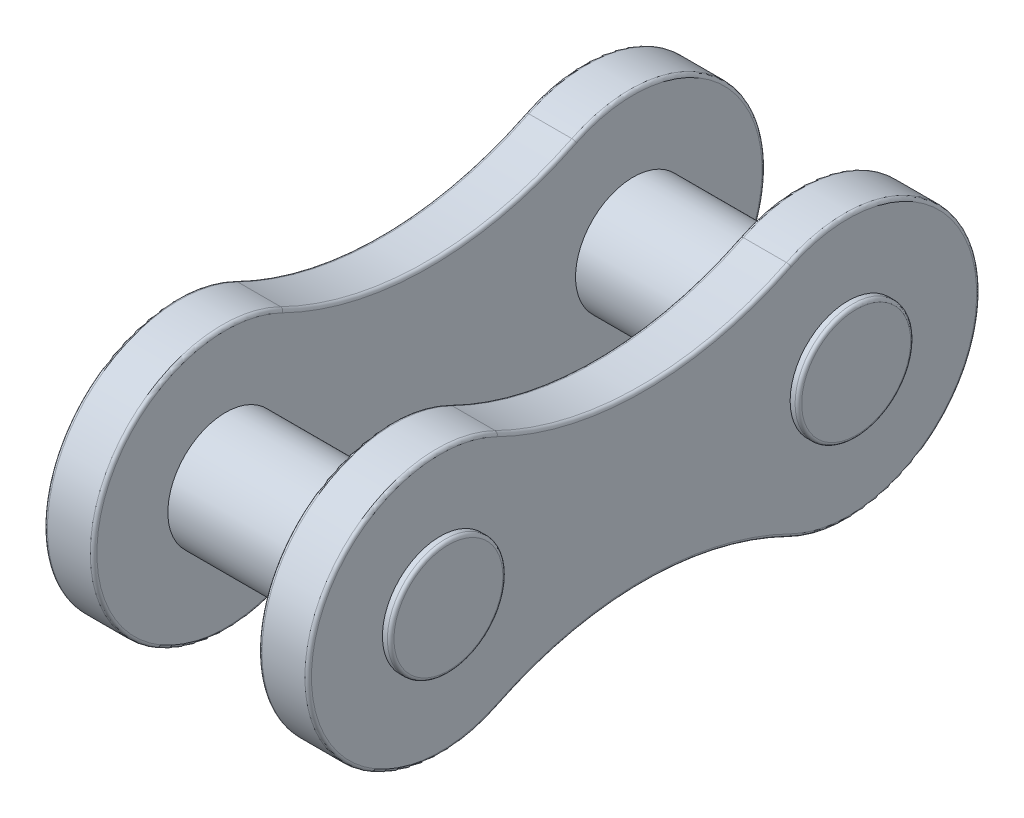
ISO-10303-21;
HEADER;
FILE_DESCRIPTION(('STEP AP214'),'2;1');
FILE_NAME('part.step','',(''),(''),'','','');
FILE_SCHEMA(('AUTOMOTIVE_DESIGN { 1 0 10303 214 1 1 1 1 }'));
ENDSEC;
DATA;
#1=APPLICATION_CONTEXT('core data for automotive mechanical design processes');
#2=APPLICATION_PROTOCOL_DEFINITION('international standard','automotive_design',2000,#1);
#3=PRODUCT_CONTEXT('',#1,'mechanical');
#4=PRODUCT('Part','Part','',(#3));
#5=PRODUCT_RELATED_PRODUCT_CATEGORY('part','',(#4));
#6=PRODUCT_DEFINITION_FORMATION('','',#4);
#7=PRODUCT_DEFINITION_CONTEXT('part definition',#1,'design');
#8=PRODUCT_DEFINITION('design','',#6,#7);
#9=PRODUCT_DEFINITION_SHAPE('','',#8);
#10=(LENGTH_UNIT() NAMED_UNIT(*) SI_UNIT(.MILLI.,.METRE.));
#11=(NAMED_UNIT(*) PLANE_ANGLE_UNIT() SI_UNIT($,.RADIAN.));
#12=(NAMED_UNIT(*) SI_UNIT($,.STERADIAN.) SOLID_ANGLE_UNIT());
#13=UNCERTAINTY_MEASURE_WITH_UNIT(LENGTH_MEASURE(1.E-05),#10,'distance_accuracy_value','');
#14=(GEOMETRIC_REPRESENTATION_CONTEXT(3) GLOBAL_UNCERTAINTY_ASSIGNED_CONTEXT((#13)) GLOBAL_UNIT_ASSIGNED_CONTEXT((#10,
#11,#12)) REPRESENTATION_CONTEXT('',''));
#15=CARTESIAN_POINT('',(0.,0.,0.));
#16=DIRECTION('',(0.,0.,1.));
#17=DIRECTION('',(1.,0.,0.));
#18=AXIS2_PLACEMENT_3D('',#15,#16,#17);
#19=CARTESIAN_POINT('',(4.,6.2823040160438,-3.0875));
#20=DIRECTION('',(1.,0.,0.));
#21=DIRECTION('',(0.,0.,-1.));
#22=AXIS2_PLACEMENT_3D('',#19,#20,#21);
#23=PLANE('',#22);
#24=CARTESIAN_POINT('',(4.,0.,-6.175));
#25=DIRECTION('',(1.,0.,0.));
#26=DIRECTION('',(0.,0.,-1.));
#27=AXIS2_PLACEMENT_3D('',#24,#25,#26);
#28=CIRCLE('',#27,3.9);
#29=CARTESIAN_POINT('',(4.,-3.50014080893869,-4.45482142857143));
#30=VERTEX_POINT('',#29);
#31=CARTESIAN_POINT('',(4.,3.50014080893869,-4.45482142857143));
#32=VERTEX_POINT('',#31);
#33=EDGE_CURVE('E54',#30,#32,#28,.T.);
#34=ORIENTED_EDGE('',*,*,#33,.T.);
#35=CARTESIAN_POINT('',(4.,12.5646080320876,0.));
#36=DIRECTION('',(1.,0.,0.));
#37=DIRECTION('',(0.,0.,-1.));
#38=AXIS2_PLACEMENT_3D('',#35,#36,#37);
#39=CIRCLE('',#38,10.1);
#40=CARTESIAN_POINT('',(4.,3.50014080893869,4.45482142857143));
#41=VERTEX_POINT('',#40);
#42=EDGE_CURVE('E244',#32,#41,#39,.F.);
#43=ORIENTED_EDGE('',*,*,#42,.T.);
#44=CARTESIAN_POINT('',(4.,0.,6.175));
#45=DIRECTION('',(1.,0.,0.));
#46=DIRECTION('',(0.,0.,-1.));
#47=AXIS2_PLACEMENT_3D('',#44,#45,#46);
#48=CIRCLE('',#47,3.9);
#49=CARTESIAN_POINT('',(4.,-3.50014080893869,4.45482142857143));
#50=VERTEX_POINT('',#49);
#51=EDGE_CURVE('E240',#41,#50,#48,.T.);
#52=ORIENTED_EDGE('',*,*,#51,.T.);
#53=CARTESIAN_POINT('',(4.,-12.5646080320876,0.));
#54=DIRECTION('',(1.,0.,0.));
#55=DIRECTION('',(0.,0.,-1.));
#56=AXIS2_PLACEMENT_3D('',#53,#54,#55);
#57=CIRCLE('',#56,10.1);
#58=EDGE_CURVE('E59',#50,#30,#57,.F.);
#59=ORIENTED_EDGE('',*,*,#58,.T.);
#60=EDGE_LOOP('',(#34,#43,#52,#59));
#61=FACE_BOUND('',#60,.T.);
#62=CARTESIAN_POINT('',(4.,0.,6.175));
#63=DIRECTION('',(1.,0.,0.));
#64=DIRECTION('',(0.,0.,-1.));
#65=AXIS2_PLACEMENT_3D('',#62,#63,#64);
#66=CIRCLE('',#65,1.75);
#67=CARTESIAN_POINT('',(4.,0.,4.425));
#68=VERTEX_POINT('',#67);
#69=EDGE_CURVE('E753',#68,#68,#66,.T.);
#70=ORIENTED_EDGE('',*,*,#69,.F.);
#71=EDGE_LOOP('',(#70));
#72=FACE_BOUND('',#71,.T.);
#73=CARTESIAN_POINT('',(4.,0.,-6.175));
#74=DIRECTION('',(1.,0.,0.));
#75=DIRECTION('',(0.,0.,1.));
#76=AXIS2_PLACEMENT_3D('',#73,#74,#75);
#77=CIRCLE('',#76,1.75);
#78=CARTESIAN_POINT('',(4.,0.,-4.425));
#79=VERTEX_POINT('',#78);
#80=EDGE_CURVE('E750',#79,#79,#77,.T.);
#81=ORIENTED_EDGE('',*,*,#80,.F.);
#82=EDGE_LOOP('',(#81));
#83=FACE_BOUND('',#82,.T.);
#84=ADVANCED_FACE('F37',(#61,#72,#83),#23,.T.);
#85=CARTESIAN_POINT('',(2.5,6.2823040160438,-3.0875));
#86=DIRECTION('',(1.,0.,0.));
#87=DIRECTION('',(0.,0.,-1.));
#88=AXIS2_PLACEMENT_3D('',#85,#86,#87);
#89=PLANE('',#88);
#90=CARTESIAN_POINT('',(2.5,0.,6.175));
#91=DIRECTION('',(1.,0.,0.));
#92=DIRECTION('',(0.,0.,-1.));
#93=AXIS2_PLACEMENT_3D('',#90,#91,#92);
#94=CIRCLE('',#93,3.9);
#95=CARTESIAN_POINT('',(2.5,-3.50014080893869,4.45482142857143));
#96=VERTEX_POINT('',#95);
#97=CARTESIAN_POINT('',(2.5,3.50014080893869,4.45482142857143));
#98=VERTEX_POINT('',#97);
#99=EDGE_CURVE('E223',#96,#98,#94,.F.);
#100=ORIENTED_EDGE('',*,*,#99,.T.);
#101=CARTESIAN_POINT('',(2.5,12.5646080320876,0.));
#102=DIRECTION('',(1.,0.,0.));
#103=DIRECTION('',(0.,0.,-1.));
#104=AXIS2_PLACEMENT_3D('',#101,#102,#103);
#105=CIRCLE('',#104,10.1);
#106=CARTESIAN_POINT('',(2.5,3.50014080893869,-4.45482142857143));
#107=VERTEX_POINT('',#106);
#108=EDGE_CURVE('E229',#98,#107,#105,.T.);
#109=ORIENTED_EDGE('',*,*,#108,.T.);
#110=CARTESIAN_POINT('',(2.5,0.,-6.175));
#111=DIRECTION('',(1.,0.,0.));
#112=DIRECTION('',(0.,0.,-1.));
#113=AXIS2_PLACEMENT_3D('',#110,#111,#112);
#114=CIRCLE('',#113,3.9);
#115=CARTESIAN_POINT('',(2.5,-3.50014080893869,-4.45482142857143));
#116=VERTEX_POINT('',#115);
#117=EDGE_CURVE('E227',#107,#116,#114,.F.);
#118=ORIENTED_EDGE('',*,*,#117,.T.);
#119=CARTESIAN_POINT('',(2.5,-12.5646080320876,0.));
#120=DIRECTION('',(1.,0.,0.));
#121=DIRECTION('',(0.,0.,-1.));
#122=AXIS2_PLACEMENT_3D('',#119,#120,#121);
#123=CIRCLE('',#122,10.1);
#124=EDGE_CURVE('E225',#116,#96,#123,.T.);
#125=ORIENTED_EDGE('',*,*,#124,.T.);
#126=EDGE_LOOP('',(#100,#109,#118,#125));
#127=FACE_BOUND('',#126,.T.);
#128=CARTESIAN_POINT('',(2.5,0.,6.175));
#129=DIRECTION('',(1.,0.,0.));
#130=DIRECTION('',(0.,0.,-1.));
#131=AXIS2_PLACEMENT_3D('',#128,#129,#130);
#132=CIRCLE('',#131,1.75);
#133=CARTESIAN_POINT('',(2.5,0.,4.425));
#134=VERTEX_POINT('',#133);
#135=EDGE_CURVE('E730',#134,#134,#132,.F.);
#136=ORIENTED_EDGE('',*,*,#135,.F.);
#137=EDGE_LOOP('',(#136));
#138=FACE_BOUND('',#137,.T.);
#139=CARTESIAN_POINT('',(2.5,0.,-6.175));
#140=DIRECTION('',(1.,0.,0.));
#141=DIRECTION('',(0.,0.,-1.));
#142=AXIS2_PLACEMENT_3D('',#139,#140,#141);
#143=CIRCLE('',#142,1.75);
#144=CARTESIAN_POINT('',(2.5,0.,-7.925));
#145=VERTEX_POINT('',#144);
#146=EDGE_CURVE('E747',#145,#145,#143,.F.);
#147=ORIENTED_EDGE('',*,*,#146,.F.);
#148=EDGE_LOOP('',(#147));
#149=FACE_BOUND('',#148,.T.);
#150=ADVANCED_FACE('F364',(#127,#138,#149),#89,.F.);
#151=CARTESIAN_POINT('',(4.,12.5646080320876,0.));
#152=DIRECTION('',(-1.,0.,0.));
#153=DIRECTION('',(0.,0.,1.));
#154=AXIS2_PLACEMENT_3D('',#151,#152,#153);
#155=CYLINDRICAL_SURFACE('',#154,10.);
#156=DIRECTION('',(-1.,0.,0.));
#157=VECTOR('',#156,1.);
#158=CARTESIAN_POINT('',(4.,3.58988800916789,-4.41071428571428));
#159=LINE('',#158,#157);
#160=CARTESIAN_POINT('',(3.9,3.58988800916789,-4.41071428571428));
#161=VERTEX_POINT('',#160);
#162=CARTESIAN_POINT('',(2.6,3.58988800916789,-4.41071428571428));
#163=VERTEX_POINT('',#162);
#164=EDGE_CURVE('E327',#161,#163,#159,.T.);
#165=ORIENTED_EDGE('',*,*,#164,.T.);
#166=CARTESIAN_POINT('',(2.6,12.5646080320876,0.));
#167=DIRECTION('',(1.,0.,0.));
#168=DIRECTION('',(0.,0.,-1.));
#169=AXIS2_PLACEMENT_3D('',#166,#167,#168);
#170=CIRCLE('',#169,10.);
#171=CARTESIAN_POINT('',(2.6,3.58988800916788,4.41071428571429));
#172=VERTEX_POINT('',#171);
#173=EDGE_CURVE('E220',#163,#172,#170,.F.);
#174=ORIENTED_EDGE('',*,*,#173,.T.);
#175=DIRECTION('',(-1.,0.,0.));
#176=VECTOR('',#175,1.);
#177=CARTESIAN_POINT('',(4.,3.58988800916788,4.41071428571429));
#178=LINE('',#177,#176);
#179=CARTESIAN_POINT('',(3.9,3.58988800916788,4.41071428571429));
#180=VERTEX_POINT('',#179);
#181=EDGE_CURVE('E324',#180,#172,#178,.T.);
#182=ORIENTED_EDGE('',*,*,#181,.F.);
#183=CARTESIAN_POINT('',(3.9,12.5646080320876,0.));
#184=DIRECTION('',(1.,0.,0.));
#185=DIRECTION('',(0.,0.,-1.));
#186=AXIS2_PLACEMENT_3D('',#183,#184,#185);
#187=CIRCLE('',#186,10.);
#188=EDGE_CURVE('E217',#180,#161,#187,.T.);
#189=ORIENTED_EDGE('',*,*,#188,.T.);
#190=EDGE_LOOP('',(#165,#174,#182,#189));
#191=FACE_BOUND('',#190,.T.);
#192=ADVANCED_FACE('F368',(#191),#155,.F.);
#193=CARTESIAN_POINT('',(4.,0.,6.175));
#194=DIRECTION('',(-1.,0.,0.));
#195=DIRECTION('',(0.,0.,1.));
#196=AXIS2_PLACEMENT_3D('',#193,#194,#195);
#197=CYLINDRICAL_SURFACE('',#196,4.);
#198=ORIENTED_EDGE('',*,*,#181,.T.);
#199=CARTESIAN_POINT('',(2.6,0.,6.175));
#200=DIRECTION('',(1.,0.,0.));
#201=DIRECTION('',(0.,0.,-1.));
#202=AXIS2_PLACEMENT_3D('',#199,#200,#201);
#203=CIRCLE('',#202,4.);
#204=CARTESIAN_POINT('',(2.6,-3.58988800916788,4.41071428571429));
#205=VERTEX_POINT('',#204);
#206=EDGE_CURVE('E258',#172,#205,#203,.T.);
#207=ORIENTED_EDGE('',*,*,#206,.T.);
#208=DIRECTION('',(-1.,0.,0.));
#209=VECTOR('',#208,1.);
#210=CARTESIAN_POINT('',(4.,-3.58988800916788,4.41071428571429));
#211=LINE('',#210,#209);
#212=CARTESIAN_POINT('',(3.9,-3.58988800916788,4.41071428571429));
#213=VERTEX_POINT('',#212);
#214=EDGE_CURVE('E315',#213,#205,#211,.T.);
#215=ORIENTED_EDGE('',*,*,#214,.F.);
#216=CARTESIAN_POINT('',(3.9,0.,6.175));
#217=DIRECTION('',(1.,0.,0.));
#218=DIRECTION('',(0.,0.,-1.));
#219=AXIS2_PLACEMENT_3D('',#216,#217,#218);
#220=CIRCLE('',#219,4.);
#221=EDGE_CURVE('E256',#213,#180,#220,.F.);
#222=ORIENTED_EDGE('',*,*,#221,.T.);
#223=EDGE_LOOP('',(#198,#207,#215,#222));
#224=FACE_BOUND('',#223,.T.);
#225=ADVANCED_FACE('F321',(#224),#197,.T.);
#226=CARTESIAN_POINT('',(4.,-12.5646080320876,0.));
#227=DIRECTION('',(-1.,0.,0.));
#228=DIRECTION('',(0.,0.,1.));
#229=AXIS2_PLACEMENT_3D('',#226,#227,#228);
#230=CYLINDRICAL_SURFACE('',#229,10.);
#231=ORIENTED_EDGE('',*,*,#214,.T.);
#232=CARTESIAN_POINT('',(2.6,-12.5646080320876,0.));
#233=DIRECTION('',(1.,0.,0.));
#234=DIRECTION('',(0.,0.,-1.));
#235=AXIS2_PLACEMENT_3D('',#232,#233,#234);
#236=CIRCLE('',#235,10.);
#237=CARTESIAN_POINT('',(2.6,-3.58988800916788,-4.41071428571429));
#238=VERTEX_POINT('',#237);
#239=EDGE_CURVE('E238',#205,#238,#236,.F.);
#240=ORIENTED_EDGE('',*,*,#239,.T.);
#241=DIRECTION('',(-1.,0.,0.));
#242=VECTOR('',#241,1.);
#243=CARTESIAN_POINT('',(4.,-3.58988800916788,-4.41071428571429));
#244=LINE('',#243,#242);
#245=CARTESIAN_POINT('',(3.9,-3.58988800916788,-4.41071428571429));
#246=VERTEX_POINT('',#245);
#247=EDGE_CURVE('E318',#246,#238,#244,.T.);
#248=ORIENTED_EDGE('',*,*,#247,.F.);
#249=CARTESIAN_POINT('',(3.9,-12.5646080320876,0.));
#250=DIRECTION('',(1.,0.,0.));
#251=DIRECTION('',(0.,0.,-1.));
#252=AXIS2_PLACEMENT_3D('',#249,#250,#251);
#253=CIRCLE('',#252,10.);
#254=EDGE_CURVE('E236',#246,#213,#253,.T.);
#255=ORIENTED_EDGE('',*,*,#254,.T.);
#256=EDGE_LOOP('',(#231,#240,#248,#255));
#257=FACE_BOUND('',#256,.T.);
#258=ADVANCED_FACE('F314',(#257),#230,.F.);
#259=CARTESIAN_POINT('',(4.,0.,-6.175));
#260=DIRECTION('',(-1.,0.,0.));
#261=DIRECTION('',(0.,0.,1.));
#262=AXIS2_PLACEMENT_3D('',#259,#260,#261);
#263=CYLINDRICAL_SURFACE('',#262,4.);
#264=ORIENTED_EDGE('',*,*,#247,.T.);
#265=CARTESIAN_POINT('',(2.6,0.,-6.175));
#266=DIRECTION('',(1.,0.,0.));
#267=DIRECTION('',(0.,0.,-1.));
#268=AXIS2_PLACEMENT_3D('',#265,#266,#267);
#269=CIRCLE('',#268,4.);
#270=EDGE_CURVE('E234',#238,#163,#269,.T.);
#271=ORIENTED_EDGE('',*,*,#270,.T.);
#272=ORIENTED_EDGE('',*,*,#164,.F.);
#273=CARTESIAN_POINT('',(3.9,0.,-6.175));
#274=DIRECTION('',(1.,0.,0.));
#275=DIRECTION('',(0.,0.,-1.));
#276=AXIS2_PLACEMENT_3D('',#273,#274,#275);
#277=CIRCLE('',#276,4.);
#278=EDGE_CURVE('E232',#161,#246,#277,.F.);
#279=ORIENTED_EDGE('',*,*,#278,.T.);
#280=EDGE_LOOP('',(#264,#271,#272,#279));
#281=FACE_BOUND('',#280,.T.);
#282=ADVANCED_FACE('F358',(#281),#263,.T.);
#283=CARTESIAN_POINT('',(4.25,0.,-6.175));
#284=DIRECTION('',(-1.,0.,0.));
#285=DIRECTION('',(0.,0.,1.));
#286=AXIS2_PLACEMENT_3D('',#283,#284,#285);
#287=CYLINDRICAL_SURFACE('',#286,1.75);
#288=CARTESIAN_POINT('',(-2.5,0.,-6.175));
#289=DIRECTION('',(1.,0.,0.));
#290=DIRECTION('',(0.,0.,-1.));
#291=AXIS2_PLACEMENT_3D('',#288,#289,#290);
#292=CIRCLE('',#291,1.75);
#293=CARTESIAN_POINT('',(-2.5,0.,-7.925));
#294=VERTEX_POINT('',#293);
#295=EDGE_CURVE('E177',#294,#294,#292,.T.);
#296=ORIENTED_EDGE('',*,*,#295,.T.);
#297=EDGE_LOOP('',(#296));
#298=FACE_BOUND('',#297,.T.);
#299=ORIENTED_EDGE('',*,*,#146,.T.);
#300=EDGE_LOOP('',(#299));
#301=FACE_BOUND('',#300,.T.);
#302=ADVANCED_FACE('F341',(#298,#301),#287,.T.);
#303=CARTESIAN_POINT('',(4.15,0.,-6.175));
#304=DIRECTION('',(1.,0.,0.));
#305=DIRECTION('',(0.,0.,-1.));
#306=AXIS2_PLACEMENT_3D('',#303,#304,#305);
#307=CIRCLE('',#306,1.75);
#308=CARTESIAN_POINT('',(4.15,0.,-7.925));
#309=VERTEX_POINT('',#308);
#310=EDGE_CURVE('E11',#309,#309,#307,.F.);
#311=ORIENTED_EDGE('',*,*,#310,.T.);
#312=EDGE_LOOP('',(#311));
#313=FACE_BOUND('',#312,.T.);
#314=ORIENTED_EDGE('',*,*,#80,.T.);
#315=EDGE_LOOP('',(#314));
#316=FACE_BOUND('',#315,.T.);
#317=ADVANCED_FACE('F342',(#313,#316),#287,.T.);
#318=CARTESIAN_POINT('',(4.25,0.,-6.175));
#319=DIRECTION('',(1.,0.,0.));
#320=DIRECTION('',(0.,0.,-1.));
#321=AXIS2_PLACEMENT_3D('',#318,#319,#320);
#322=PLANE('',#321);
#323=CARTESIAN_POINT('',(4.25,0.,-6.175));
#324=DIRECTION('',(1.,0.,0.));
#325=DIRECTION('',(0.,0.,-1.));
#326=AXIS2_PLACEMENT_3D('',#323,#324,#325);
#327=CIRCLE('',#326,1.65);
#328=CARTESIAN_POINT('',(4.25,0.,-7.825));
#329=VERTEX_POINT('',#328);
#330=EDGE_CURVE('E46',#329,#329,#327,.T.);
#331=ORIENTED_EDGE('',*,*,#330,.T.);
#332=EDGE_LOOP('',(#331));
#333=FACE_BOUND('',#332,.T.);
#334=ADVANCED_FACE('F361',(#333),#322,.T.);
#335=CARTESIAN_POINT('',(-4.,0.,-6.175));
#336=DIRECTION('',(1.,0.,0.));
#337=DIRECTION('',(0.,0.,-1.));
#338=AXIS2_PLACEMENT_3D('',#335,#336,#337);
#339=CYLINDRICAL_SURFACE('',#338,4.);
#340=DIRECTION('',(1.,0.,0.));
#341=VECTOR('',#340,1.);
#342=CARTESIAN_POINT('',(-4.,-3.58988800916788,-4.41071428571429));
#343=LINE('',#342,#341);
#344=CARTESIAN_POINT('',(-3.9,-3.58988800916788,-4.41071428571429));
#345=VERTEX_POINT('',#344);
#346=CARTESIAN_POINT('',(-2.6,-3.58988800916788,-4.41071428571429));
#347=VERTEX_POINT('',#346);
#348=EDGE_CURVE('E158',#345,#347,#343,.T.);
#349=ORIENTED_EDGE('',*,*,#348,.F.);
#350=CARTESIAN_POINT('',(-3.9,0.,-6.175));
#351=DIRECTION('',(1.,0.,0.));
#352=DIRECTION('',(0.,0.,-1.));
#353=AXIS2_PLACEMENT_3D('',#350,#351,#352);
#354=CIRCLE('',#353,4.);
#355=CARTESIAN_POINT('',(-3.9,3.58988800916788,-4.41071428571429));
#356=VERTEX_POINT('',#355);
#357=EDGE_CURVE('E153',#345,#356,#354,.T.);
#358=ORIENTED_EDGE('',*,*,#357,.T.);
#359=DIRECTION('',(1.,0.,0.));
#360=VECTOR('',#359,1.);
#361=CARTESIAN_POINT('',(-4.,3.58988800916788,-4.41071428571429));
#362=LINE('',#361,#360);
#363=CARTESIAN_POINT('',(-2.6,3.58988800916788,-4.41071428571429));
#364=VERTEX_POINT('',#363);
#365=EDGE_CURVE('E156',#356,#364,#362,.T.);
#366=ORIENTED_EDGE('',*,*,#365,.T.);
#367=CARTESIAN_POINT('',(-2.6,0.,-6.175));
#368=DIRECTION('',(1.,0.,0.));
#369=DIRECTION('',(0.,0.,-1.));
#370=AXIS2_PLACEMENT_3D('',#367,#368,#369);
#371=CIRCLE('',#370,4.);
#372=EDGE_CURVE('E164',#364,#347,#371,.F.);
#373=ORIENTED_EDGE('',*,*,#372,.T.);
#374=EDGE_LOOP('',(#349,#358,#366,#373));
#375=FACE_BOUND('',#374,.T.);
#376=ADVANCED_FACE('F155',(#375),#339,.T.);
#377=CARTESIAN_POINT('',(-4.,-12.5646080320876,0.));
#378=DIRECTION('',(1.,0.,0.));
#379=DIRECTION('',(0.,0.,-1.));
#380=AXIS2_PLACEMENT_3D('',#377,#378,#379);
#381=CYLINDRICAL_SURFACE('',#380,10.);
#382=DIRECTION('',(1.,0.,0.));
#383=VECTOR('',#382,1.);
#384=CARTESIAN_POINT('',(-4.,-3.58988800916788,4.41071428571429));
#385=LINE('',#384,#383);
#386=CARTESIAN_POINT('',(-3.9,-3.58988800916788,4.41071428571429));
#387=VERTEX_POINT('',#386);
#388=CARTESIAN_POINT('',(-2.6,-3.58988800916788,4.41071428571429));
#389=VERTEX_POINT('',#388);
#390=EDGE_CURVE('E742',#387,#389,#385,.T.);
#391=ORIENTED_EDGE('',*,*,#390,.F.);
#392=CARTESIAN_POINT('',(-3.9,-12.5646080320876,0.));
#393=DIRECTION('',(1.,0.,0.));
#394=DIRECTION('',(0.,0.,-1.));
#395=AXIS2_PLACEMENT_3D('',#392,#393,#394);
#396=CIRCLE('',#395,10.);
#397=EDGE_CURVE('E206',#387,#345,#396,.F.);
#398=ORIENTED_EDGE('',*,*,#397,.T.);
#399=ORIENTED_EDGE('',*,*,#348,.T.);
#400=CARTESIAN_POINT('',(-2.6,-12.5646080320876,0.));
#401=DIRECTION('',(1.,0.,0.));
#402=DIRECTION('',(0.,0.,-1.));
#403=AXIS2_PLACEMENT_3D('',#400,#401,#402);
#404=CIRCLE('',#403,10.);
#405=EDGE_CURVE('E163',#347,#389,#404,.T.);
#406=ORIENTED_EDGE('',*,*,#405,.T.);
#407=EDGE_LOOP('',(#391,#398,#399,#406));
#408=FACE_BOUND('',#407,.T.);
#409=ADVANCED_FACE('F469',(#408),#381,.F.);
#410=CARTESIAN_POINT('',(-4.,0.,6.175));
#411=DIRECTION('',(1.,0.,0.));
#412=DIRECTION('',(0.,0.,-1.));
#413=AXIS2_PLACEMENT_3D('',#410,#411,#412);
#414=CYLINDRICAL_SURFACE('',#413,4.);
#415=DIRECTION('',(1.,0.,0.));
#416=VECTOR('',#415,1.);
#417=CARTESIAN_POINT('',(-4.,3.58988800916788,4.41071428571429));
#418=LINE('',#417,#416);
#419=CARTESIAN_POINT('',(-3.9,3.58988800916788,4.41071428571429));
#420=VERTEX_POINT('',#419);
#421=CARTESIAN_POINT('',(-2.6,3.58988800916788,4.41071428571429));
#422=VERTEX_POINT('',#421);
#423=EDGE_CURVE('E176',#420,#422,#418,.T.);
#424=ORIENTED_EDGE('',*,*,#423,.F.);
#425=CARTESIAN_POINT('',(-3.9,0.,6.175));
#426=DIRECTION('',(1.,0.,0.));
#427=DIRECTION('',(0.,0.,-1.));
#428=AXIS2_PLACEMENT_3D('',#425,#426,#427);
#429=CIRCLE('',#428,4.);
#430=EDGE_CURVE('E254',#420,#387,#429,.T.);
#431=ORIENTED_EDGE('',*,*,#430,.T.);
#432=ORIENTED_EDGE('',*,*,#390,.T.);
#433=CARTESIAN_POINT('',(-2.6,0.,6.175));
#434=DIRECTION('',(1.,0.,0.));
#435=DIRECTION('',(0.,0.,-1.));
#436=AXIS2_PLACEMENT_3D('',#433,#434,#435);
#437=CIRCLE('',#436,4.);
#438=EDGE_CURVE('E252',#389,#422,#437,.F.);
#439=ORIENTED_EDGE('',*,*,#438,.T.);
#440=EDGE_LOOP('',(#424,#431,#432,#439));
#441=FACE_BOUND('',#440,.T.);
#442=ADVANCED_FACE('F472',(#441),#414,.T.);
#443=CARTESIAN_POINT('',(-4.,12.5646080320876,0.));
#444=DIRECTION('',(1.,0.,0.));
#445=DIRECTION('',(0.,0.,-1.));
#446=AXIS2_PLACEMENT_3D('',#443,#444,#445);
#447=CYLINDRICAL_SURFACE('',#446,10.);
#448=ORIENTED_EDGE('',*,*,#365,.F.);
#449=CARTESIAN_POINT('',(-3.9,12.5646080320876,0.));
#450=DIRECTION('',(1.,0.,0.));
#451=DIRECTION('',(0.,0.,-1.));
#452=AXIS2_PLACEMENT_3D('',#449,#450,#451);
#453=CIRCLE('',#452,10.);
#454=EDGE_CURVE('E172',#356,#420,#453,.F.);
#455=ORIENTED_EDGE('',*,*,#454,.T.);
#456=ORIENTED_EDGE('',*,*,#423,.T.);
#457=CARTESIAN_POINT('',(-2.6,12.5646080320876,0.));
#458=DIRECTION('',(1.,0.,0.));
#459=DIRECTION('',(0.,0.,-1.));
#460=AXIS2_PLACEMENT_3D('',#457,#458,#459);
#461=CIRCLE('',#460,10.);
#462=EDGE_CURVE('E175',#422,#364,#461,.T.);
#463=ORIENTED_EDGE('',*,*,#462,.T.);
#464=EDGE_LOOP('',(#448,#455,#456,#463));
#465=FACE_BOUND('',#464,.T.);
#466=ADVANCED_FACE('F169',(#465),#447,.F.);
#467=CARTESIAN_POINT('',(-4.,6.2823040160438,-3.0875));
#468=DIRECTION('',(1.,0.,0.));
#469=DIRECTION('',(0.,0.,-1.));
#470=AXIS2_PLACEMENT_3D('',#467,#468,#469);
#471=PLANE('',#470);
#472=CARTESIAN_POINT('',(-4.,0.,6.175));
#473=DIRECTION('',(1.,0.,0.));
#474=DIRECTION('',(0.,0.,-1.));
#475=AXIS2_PLACEMENT_3D('',#472,#473,#474);
#476=CIRCLE('',#475,3.9);
#477=CARTESIAN_POINT('',(-4.,-3.50014080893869,4.45482142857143));
#478=VERTEX_POINT('',#477);
#479=CARTESIAN_POINT('',(-4.,3.50014080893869,4.45482142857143));
#480=VERTEX_POINT('',#479);
#481=EDGE_CURVE('E192',#478,#480,#476,.F.);
#482=ORIENTED_EDGE('',*,*,#481,.T.);
#483=CARTESIAN_POINT('',(-4.,12.5646080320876,0.));
#484=DIRECTION('',(1.,0.,0.));
#485=DIRECTION('',(0.,0.,-1.));
#486=AXIS2_PLACEMENT_3D('',#483,#484,#485);
#487=CIRCLE('',#486,10.1);
#488=CARTESIAN_POINT('',(-4.,3.50014080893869,-4.45482142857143));
#489=VERTEX_POINT('',#488);
#490=EDGE_CURVE('E202',#480,#489,#487,.T.);
#491=ORIENTED_EDGE('',*,*,#490,.T.);
#492=CARTESIAN_POINT('',(-4.,0.,-6.175));
#493=DIRECTION('',(1.,0.,0.));
#494=DIRECTION('',(0.,0.,-1.));
#495=AXIS2_PLACEMENT_3D('',#492,#493,#494);
#496=CIRCLE('',#495,3.9);
#497=CARTESIAN_POINT('',(-4.,-3.50014080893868,-4.45482142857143));
#498=VERTEX_POINT('',#497);
#499=EDGE_CURVE('E182',#489,#498,#496,.F.);
#500=ORIENTED_EDGE('',*,*,#499,.T.);
#501=CARTESIAN_POINT('',(-4.,-12.5646080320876,0.));
#502=DIRECTION('',(1.,0.,0.));
#503=DIRECTION('',(0.,0.,-1.));
#504=AXIS2_PLACEMENT_3D('',#501,#502,#503);
#505=CIRCLE('',#504,10.1);
#506=EDGE_CURVE('E194',#498,#478,#505,.T.);
#507=ORIENTED_EDGE('',*,*,#506,.T.);
#508=EDGE_LOOP('',(#482,#491,#500,#507));
#509=FACE_BOUND('',#508,.T.);
#510=CARTESIAN_POINT('',(-4.,0.,6.175));
#511=DIRECTION('',(1.,0.,0.));
#512=DIRECTION('',(0.,0.,-1.));
#513=AXIS2_PLACEMENT_3D('',#510,#511,#512);
#514=CIRCLE('',#513,1.75);
#515=CARTESIAN_POINT('',(-4.,0.,4.425));
#516=VERTEX_POINT('',#515);
#517=EDGE_CURVE('E274',#516,#516,#514,.F.);
#518=ORIENTED_EDGE('',*,*,#517,.F.);
#519=EDGE_LOOP('',(#518));
#520=FACE_BOUND('',#519,.T.);
#521=CARTESIAN_POINT('',(-4.,0.,-6.175));
#522=DIRECTION('',(1.,0.,0.));
#523=DIRECTION('',(0.,0.,-1.));
#524=AXIS2_PLACEMENT_3D('',#521,#522,#523);
#525=CIRCLE('',#524,1.75);
#526=CARTESIAN_POINT('',(-4.,0.,-7.925));
#527=VERTEX_POINT('',#526);
#528=EDGE_CURVE('E196',#527,#527,#525,.T.);
#529=ORIENTED_EDGE('',*,*,#528,.T.);
#530=EDGE_LOOP('',(#529));
#531=FACE_BOUND('',#530,.T.);
#532=ADVANCED_FACE('F333',(#509,#520,#531),#471,.F.);
#533=CARTESIAN_POINT('',(-2.5,6.2823040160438,-3.0875));
#534=DIRECTION('',(1.,0.,0.));
#535=DIRECTION('',(0.,0.,-1.));
#536=AXIS2_PLACEMENT_3D('',#533,#534,#535);
#537=PLANE('',#536);
#538=CARTESIAN_POINT('',(-2.5,0.,-6.175));
#539=DIRECTION('',(1.,0.,0.));
#540=DIRECTION('',(0.,0.,-1.));
#541=AXIS2_PLACEMENT_3D('',#538,#539,#540);
#542=CIRCLE('',#541,3.9);
#543=CARTESIAN_POINT('',(-2.5,-3.50014080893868,-4.45482142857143));
#544=VERTEX_POINT('',#543);
#545=CARTESIAN_POINT('',(-2.5,3.50014080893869,-4.45482142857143));
#546=VERTEX_POINT('',#545);
#547=EDGE_CURVE('E212',#544,#546,#542,.T.);
#548=ORIENTED_EDGE('',*,*,#547,.T.);
#549=CARTESIAN_POINT('',(-2.5,12.5646080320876,0.));
#550=DIRECTION('',(1.,0.,0.));
#551=DIRECTION('',(0.,0.,-1.));
#552=AXIS2_PLACEMENT_3D('',#549,#550,#551);
#553=CIRCLE('',#552,10.1);
#554=CARTESIAN_POINT('',(-2.5,3.50014080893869,4.45482142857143));
#555=VERTEX_POINT('',#554);
#556=EDGE_CURVE('E214',#546,#555,#553,.F.);
#557=ORIENTED_EDGE('',*,*,#556,.T.);
#558=CARTESIAN_POINT('',(-2.5,0.,6.175));
#559=DIRECTION('',(1.,0.,0.));
#560=DIRECTION('',(0.,0.,-1.));
#561=AXIS2_PLACEMENT_3D('',#558,#559,#560);
#562=CIRCLE('',#561,3.9);
#563=CARTESIAN_POINT('',(-2.5,-3.50014080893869,4.45482142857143));
#564=VERTEX_POINT('',#563);
#565=EDGE_CURVE('E208',#555,#564,#562,.T.);
#566=ORIENTED_EDGE('',*,*,#565,.T.);
#567=CARTESIAN_POINT('',(-2.5,-12.5646080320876,0.));
#568=DIRECTION('',(1.,0.,0.));
#569=DIRECTION('',(0.,0.,-1.));
#570=AXIS2_PLACEMENT_3D('',#567,#568,#569);
#571=CIRCLE('',#570,10.1);
#572=EDGE_CURVE('E210',#564,#544,#571,.F.);
#573=ORIENTED_EDGE('',*,*,#572,.T.);
#574=EDGE_LOOP('',(#548,#557,#566,#573));
#575=FACE_BOUND('',#574,.T.);
#576=CARTESIAN_POINT('',(-2.5,0.,6.175));
#577=DIRECTION('',(1.,0.,0.));
#578=DIRECTION('',(0.,0.,-1.));
#579=AXIS2_PLACEMENT_3D('',#576,#577,#578);
#580=CIRCLE('',#579,1.75);
#581=CARTESIAN_POINT('',(-2.5,0.,4.425));
#582=VERTEX_POINT('',#581);
#583=EDGE_CURVE('E733',#582,#582,#580,.T.);
#584=ORIENTED_EDGE('',*,*,#583,.F.);
#585=EDGE_LOOP('',(#584));
#586=FACE_BOUND('',#585,.T.);
#587=ORIENTED_EDGE('',*,*,#295,.F.);
#588=EDGE_LOOP('',(#587));
#589=FACE_BOUND('',#588,.T.);
#590=ADVANCED_FACE('F352',(#575,#586,#589),#537,.T.);
#591=CARTESIAN_POINT('',(-4.25,0.,-6.175));
#592=DIRECTION('',(1.,0.,0.));
#593=DIRECTION('',(0.,0.,-1.));
#594=AXIS2_PLACEMENT_3D('',#591,#592,#593);
#595=PLANE('',#594);
#596=CARTESIAN_POINT('',(-4.25,0.,-6.175));
#597=DIRECTION('',(1.,0.,0.));
#598=DIRECTION('',(0.,0.,-1.));
#599=AXIS2_PLACEMENT_3D('',#596,#597,#598);
#600=CIRCLE('',#599,1.75);
#601=CARTESIAN_POINT('',(-4.25,0.,-7.925));
#602=VERTEX_POINT('',#601);
#603=EDGE_CURVE('E741',#602,#602,#600,.T.);
#604=ORIENTED_EDGE('',*,*,#603,.F.);
#605=EDGE_LOOP('',(#604));
#606=FACE_BOUND('',#605,.T.);
#607=ADVANCED_FACE('F338',(#606),#595,.F.);
#608=ORIENTED_EDGE('',*,*,#603,.T.);
#609=EDGE_LOOP('',(#608));
#610=FACE_BOUND('',#609,.T.);
#611=ORIENTED_EDGE('',*,*,#528,.F.);
#612=EDGE_LOOP('',(#611));
#613=FACE_BOUND('',#612,.T.);
#614=ADVANCED_FACE('F335',(#610,#613),#287,.T.);
#615=CARTESIAN_POINT('',(4.25,0.,6.175));
#616=DIRECTION('',(-1.,0.,0.));
#617=DIRECTION('',(0.,0.,1.));
#618=AXIS2_PLACEMENT_3D('',#615,#616,#617);
#619=CYLINDRICAL_SURFACE('',#618,1.75);
#620=ORIENTED_EDGE('',*,*,#583,.T.);
#621=EDGE_LOOP('',(#620));
#622=FACE_BOUND('',#621,.T.);
#623=ORIENTED_EDGE('',*,*,#135,.T.);
#624=EDGE_LOOP('',(#623));
#625=FACE_BOUND('',#624,.T.);
#626=ADVANCED_FACE('F337',(#622,#625),#619,.T.);
#627=CARTESIAN_POINT('',(-4.25,0.,6.175));
#628=DIRECTION('',(1.,0.,0.));
#629=DIRECTION('',(0.,0.,-1.));
#630=AXIS2_PLACEMENT_3D('',#627,#628,#629);
#631=PLANE('',#630);
#632=CARTESIAN_POINT('',(-4.25,0.,6.175));
#633=DIRECTION('',(1.,0.,0.));
#634=DIRECTION('',(0.,0.,-1.));
#635=AXIS2_PLACEMENT_3D('',#632,#633,#634);
#636=CIRCLE('',#635,1.65);
#637=CARTESIAN_POINT('',(-4.25,0.,4.525));
#638=VERTEX_POINT('',#637);
#639=EDGE_CURVE('E249',#638,#638,#636,.F.);
#640=ORIENTED_EDGE('',*,*,#639,.T.);
#641=EDGE_LOOP('',(#640));
#642=FACE_BOUND('',#641,.T.);
#643=ADVANCED_FACE('F347',(#642),#631,.F.);
#644=CARTESIAN_POINT('',(-4.15,0.,6.175));
#645=DIRECTION('',(1.,0.,0.));
#646=DIRECTION('',(0.,0.,-1.));
#647=AXIS2_PLACEMENT_3D('',#644,#645,#646);
#648=CIRCLE('',#647,1.75);
#649=CARTESIAN_POINT('',(-4.15,0.,4.425));
#650=VERTEX_POINT('',#649);
#651=EDGE_CURVE('E246',#650,#650,#648,.T.);
#652=ORIENTED_EDGE('',*,*,#651,.T.);
#653=EDGE_LOOP('',(#652));
#654=FACE_BOUND('',#653,.T.);
#655=ORIENTED_EDGE('',*,*,#517,.T.);
#656=EDGE_LOOP('',(#655));
#657=FACE_BOUND('',#656,.T.);
#658=ADVANCED_FACE('F350',(#654,#657),#619,.T.);
#659=CARTESIAN_POINT('',(4.15,0.,6.175));
#660=DIRECTION('',(1.,0.,0.));
#661=DIRECTION('',(0.,0.,-1.));
#662=AXIS2_PLACEMENT_3D('',#659,#660,#661);
#663=CIRCLE('',#662,1.75);
#664=CARTESIAN_POINT('',(4.15,0.,4.425));
#665=VERTEX_POINT('',#664);
#666=EDGE_CURVE('E263',#665,#665,#663,.F.);
#667=ORIENTED_EDGE('',*,*,#666,.T.);
#668=EDGE_LOOP('',(#667));
#669=FACE_BOUND('',#668,.T.);
#670=ORIENTED_EDGE('',*,*,#69,.T.);
#671=EDGE_LOOP('',(#670));
#672=FACE_BOUND('',#671,.T.);
#673=ADVANCED_FACE('F351',(#669,#672),#619,.T.);
#674=CARTESIAN_POINT('',(4.25,0.,6.175));
#675=DIRECTION('',(1.,0.,0.));
#676=DIRECTION('',(0.,0.,-1.));
#677=AXIS2_PLACEMENT_3D('',#674,#675,#676);
#678=PLANE('',#677);
#679=CARTESIAN_POINT('',(4.25,0.,6.175));
#680=DIRECTION('',(1.,0.,0.));
#681=DIRECTION('',(0.,0.,-1.));
#682=AXIS2_PLACEMENT_3D('',#679,#680,#681);
#683=CIRCLE('',#682,1.65);
#684=CARTESIAN_POINT('',(4.25,0.,4.525));
#685=VERTEX_POINT('',#684);
#686=EDGE_CURVE('E260',#685,#685,#683,.T.);
#687=ORIENTED_EDGE('',*,*,#686,.T.);
#688=EDGE_LOOP('',(#687));
#689=FACE_BOUND('',#688,.T.);
#690=ADVANCED_FACE('F395',(#689),#678,.T.);
#691=CARTESIAN_POINT('',(-3.9,-12.5646080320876,0.));
#692=DIRECTION('',(1.,0.,0.));
#693=DIRECTION('',(0.,0.,-1.));
#694=AXIS2_PLACEMENT_3D('',#691,#692,#693);
#695=TOROIDAL_SURFACE('',#694,10.1,0.1);
#696=CARTESIAN_POINT('',(-3.9,-3.50014080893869,4.45482142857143));
#697=DIRECTION('',(0.,-0.441071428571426,0.897472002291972));
#698=DIRECTION('',(0.,-0.897472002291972,-0.441071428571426));
#699=AXIS2_PLACEMENT_3D('',#696,#697,#698);
#700=CIRCLE('',#699,0.1);
#701=EDGE_CURVE('E186',#478,#387,#700,.T.);
#702=ORIENTED_EDGE('',*,*,#701,.F.);
#703=ORIENTED_EDGE('',*,*,#506,.F.);
#704=CARTESIAN_POINT('',(-3.9,-3.50014080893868,-4.45482142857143));
#705=DIRECTION('',(0.,-0.441071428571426,-0.897472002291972));
#706=DIRECTION('',(0.,0.897472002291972,-0.441071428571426));
#707=AXIS2_PLACEMENT_3D('',#704,#705,#706);
#708=CIRCLE('',#707,0.1);
#709=EDGE_CURVE('E272',#345,#498,#708,.T.);
#710=ORIENTED_EDGE('',*,*,#709,.F.);
#711=ORIENTED_EDGE('',*,*,#397,.F.);
#712=EDGE_LOOP('',(#702,#703,#710,#711));
#713=FACE_BOUND('',#712,.T.);
#714=ADVANCED_FACE('F392',(#713),#695,.T.);
#715=CARTESIAN_POINT('',(-3.9,0.,-6.175));
#716=DIRECTION('',(1.,0.,0.));
#717=DIRECTION('',(0.,0.,-1.));
#718=AXIS2_PLACEMENT_3D('',#715,#716,#717);
#719=TOROIDAL_SURFACE('',#718,3.9,0.1);
#720=ORIENTED_EDGE('',*,*,#709,.T.);
#721=ORIENTED_EDGE('',*,*,#499,.F.);
#722=CARTESIAN_POINT('',(-3.9,3.50014080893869,-4.45482142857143));
#723=DIRECTION('',(0.,-0.441071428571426,0.897472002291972));
#724=DIRECTION('',(0.,-0.897472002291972,-0.441071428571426));
#725=AXIS2_PLACEMENT_3D('',#722,#723,#724);
#726=CIRCLE('',#725,0.1);
#727=EDGE_CURVE('E180',#356,#489,#726,.T.);
#728=ORIENTED_EDGE('',*,*,#727,.F.);
#729=ORIENTED_EDGE('',*,*,#357,.F.);
#730=EDGE_LOOP('',(#720,#721,#728,#729));
#731=FACE_BOUND('',#730,.T.);
#732=ADVANCED_FACE('F181',(#731),#719,.T.);
#733=CARTESIAN_POINT('',(-3.9,0.,6.175));
#734=DIRECTION('',(1.,0.,0.));
#735=DIRECTION('',(0.,0.,-1.));
#736=AXIS2_PLACEMENT_3D('',#733,#734,#735);
#737=TOROIDAL_SURFACE('',#736,3.9,0.1);
#738=ORIENTED_EDGE('',*,*,#701,.T.);
#739=ORIENTED_EDGE('',*,*,#430,.F.);
#740=CARTESIAN_POINT('',(-3.9,3.50014080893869,4.45482142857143));
#741=DIRECTION('',(0.,-0.441071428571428,-0.897472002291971));
#742=DIRECTION('',(0.,0.897472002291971,-0.441071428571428));
#743=AXIS2_PLACEMENT_3D('',#740,#741,#742);
#744=CIRCLE('',#743,0.1);
#745=EDGE_CURVE('E187',#480,#420,#744,.T.);
#746=ORIENTED_EDGE('',*,*,#745,.F.);
#747=ORIENTED_EDGE('',*,*,#481,.F.);
#748=EDGE_LOOP('',(#738,#739,#746,#747));
#749=FACE_BOUND('',#748,.T.);
#750=ADVANCED_FACE('F386',(#749),#737,.T.);
#751=CARTESIAN_POINT('',(-3.9,12.5646080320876,0.));
#752=DIRECTION('',(1.,0.,0.));
#753=DIRECTION('',(0.,0.,-1.));
#754=AXIS2_PLACEMENT_3D('',#751,#752,#753);
#755=TOROIDAL_SURFACE('',#754,10.1,0.1);
#756=ORIENTED_EDGE('',*,*,#727,.T.);
#757=ORIENTED_EDGE('',*,*,#490,.F.);
#758=ORIENTED_EDGE('',*,*,#745,.T.);
#759=ORIENTED_EDGE('',*,*,#454,.F.);
#760=EDGE_LOOP('',(#756,#757,#758,#759));
#761=FACE_BOUND('',#760,.T.);
#762=ADVANCED_FACE('F189',(#761),#755,.T.);
#763=CARTESIAN_POINT('',(-2.6,-12.5646080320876,0.));
#764=DIRECTION('',(1.,0.,0.));
#765=DIRECTION('',(0.,0.,-1.));
#766=AXIS2_PLACEMENT_3D('',#763,#764,#765);
#767=TOROIDAL_SURFACE('',#766,10.1,0.1);
#768=CARTESIAN_POINT('',(-2.6,-3.50014080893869,4.45482142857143));
#769=DIRECTION('',(0.,-0.441071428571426,0.897472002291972));
#770=DIRECTION('',(0.,-0.897472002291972,-0.441071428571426));
#771=AXIS2_PLACEMENT_3D('',#768,#769,#770);
#772=CIRCLE('',#771,0.1);
#773=EDGE_CURVE('E280',#389,#564,#772,.T.);
#774=ORIENTED_EDGE('',*,*,#773,.F.);
#775=ORIENTED_EDGE('',*,*,#405,.F.);
#776=CARTESIAN_POINT('',(-2.6,-3.50014080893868,-4.45482142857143));
#777=DIRECTION('',(0.,-0.441071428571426,-0.897472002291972));
#778=DIRECTION('',(0.,0.897472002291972,-0.441071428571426));
#779=AXIS2_PLACEMENT_3D('',#776,#777,#778);
#780=CIRCLE('',#779,0.1);
#781=EDGE_CURVE('E268',#544,#347,#780,.T.);
#782=ORIENTED_EDGE('',*,*,#781,.F.);
#783=ORIENTED_EDGE('',*,*,#572,.F.);
#784=EDGE_LOOP('',(#774,#775,#782,#783));
#785=FACE_BOUND('',#784,.T.);
#786=ADVANCED_FACE('F385',(#785),#767,.T.);
#787=CARTESIAN_POINT('',(-2.6,0.,-6.175));
#788=DIRECTION('',(1.,0.,0.));
#789=DIRECTION('',(0.,0.,-1.));
#790=AXIS2_PLACEMENT_3D('',#787,#788,#789);
#791=TOROIDAL_SURFACE('',#790,3.9,0.1);
#792=ORIENTED_EDGE('',*,*,#781,.T.);
#793=ORIENTED_EDGE('',*,*,#372,.F.);
#794=CARTESIAN_POINT('',(-2.6,3.50014080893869,-4.45482142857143));
#795=DIRECTION('',(0.,-0.441071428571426,0.897472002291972));
#796=DIRECTION('',(0.,-0.897472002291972,-0.441071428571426));
#797=AXIS2_PLACEMENT_3D('',#794,#795,#796);
#798=CIRCLE('',#797,0.1);
#799=EDGE_CURVE('E277',#546,#364,#798,.T.);
#800=ORIENTED_EDGE('',*,*,#799,.F.);
#801=ORIENTED_EDGE('',*,*,#547,.F.);
#802=EDGE_LOOP('',(#792,#793,#800,#801));
#803=FACE_BOUND('',#802,.T.);
#804=ADVANCED_FACE('F405',(#803),#791,.T.);
#805=CARTESIAN_POINT('',(-2.6,0.,6.175));
#806=DIRECTION('',(1.,0.,0.));
#807=DIRECTION('',(0.,0.,-1.));
#808=AXIS2_PLACEMENT_3D('',#805,#806,#807);
#809=TOROIDAL_SURFACE('',#808,3.9,0.1);
#810=ORIENTED_EDGE('',*,*,#773,.T.);
#811=ORIENTED_EDGE('',*,*,#565,.F.);
#812=CARTESIAN_POINT('',(-2.6,3.50014080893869,4.45482142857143));
#813=DIRECTION('',(0.,-0.441071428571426,-0.897472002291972));
#814=DIRECTION('',(0.,0.897472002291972,-0.441071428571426));
#815=AXIS2_PLACEMENT_3D('',#812,#813,#814);
#816=CIRCLE('',#815,0.1);
#817=EDGE_CURVE('E275',#422,#555,#816,.T.);
#818=ORIENTED_EDGE('',*,*,#817,.F.);
#819=ORIENTED_EDGE('',*,*,#438,.F.);
#820=EDGE_LOOP('',(#810,#811,#818,#819));
#821=FACE_BOUND('',#820,.T.);
#822=ADVANCED_FACE('F401',(#821),#809,.T.);
#823=CARTESIAN_POINT('',(-2.6,12.5646080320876,0.));
#824=DIRECTION('',(1.,0.,0.));
#825=DIRECTION('',(0.,0.,-1.));
#826=AXIS2_PLACEMENT_3D('',#823,#824,#825);
#827=TOROIDAL_SURFACE('',#826,10.1,0.1);
#828=ORIENTED_EDGE('',*,*,#799,.T.);
#829=ORIENTED_EDGE('',*,*,#462,.F.);
#830=ORIENTED_EDGE('',*,*,#817,.T.);
#831=ORIENTED_EDGE('',*,*,#556,.F.);
#832=EDGE_LOOP('',(#828,#829,#830,#831));
#833=FACE_BOUND('',#832,.T.);
#834=ADVANCED_FACE('F397',(#833),#827,.T.);
#835=CARTESIAN_POINT('',(2.6,-12.5646080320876,0.));
#836=DIRECTION('',(1.,0.,0.));
#837=DIRECTION('',(0.,0.,-1.));
#838=AXIS2_PLACEMENT_3D('',#835,#836,#837);
#839=TOROIDAL_SURFACE('',#838,10.1,0.1);
#840=CARTESIAN_POINT('',(2.6,-3.50014080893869,4.45482142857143));
#841=DIRECTION('',(0.,-0.441071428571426,0.897472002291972));
#842=DIRECTION('',(0.,-0.897472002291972,-0.441071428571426));
#843=AXIS2_PLACEMENT_3D('',#840,#841,#842);
#844=CIRCLE('',#843,0.1);
#845=EDGE_CURVE('E289',#96,#205,#844,.T.);
#846=ORIENTED_EDGE('',*,*,#845,.F.);
#847=ORIENTED_EDGE('',*,*,#124,.F.);
#848=CARTESIAN_POINT('',(2.6,-3.50014080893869,-4.45482142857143));
#849=DIRECTION('',(0.,-0.441071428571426,-0.897472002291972));
#850=DIRECTION('',(0.,0.897472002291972,-0.441071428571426));
#851=AXIS2_PLACEMENT_3D('',#848,#849,#850);
#852=CIRCLE('',#851,0.1);
#853=EDGE_CURVE('E278',#238,#116,#852,.T.);
#854=ORIENTED_EDGE('',*,*,#853,.F.);
#855=ORIENTED_EDGE('',*,*,#239,.F.);
#856=EDGE_LOOP('',(#846,#847,#854,#855));
#857=FACE_BOUND('',#856,.T.);
#858=ADVANCED_FACE('F400',(#857),#839,.T.);
#859=CARTESIAN_POINT('',(2.6,0.,-6.175));
#860=DIRECTION('',(1.,0.,0.));
#861=DIRECTION('',(0.,0.,-1.));
#862=AXIS2_PLACEMENT_3D('',#859,#860,#861);
#863=TOROIDAL_SURFACE('',#862,3.9,0.1);
#864=ORIENTED_EDGE('',*,*,#853,.T.);
#865=ORIENTED_EDGE('',*,*,#117,.F.);
#866=CARTESIAN_POINT('',(2.6,3.50014080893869,-4.45482142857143));
#867=DIRECTION('',(0.,-0.441071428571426,0.897472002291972));
#868=DIRECTION('',(0.,-0.897472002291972,-0.441071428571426));
#869=AXIS2_PLACEMENT_3D('',#866,#867,#868);
#870=CIRCLE('',#869,0.1);
#871=EDGE_CURVE('E287',#163,#107,#870,.T.);
#872=ORIENTED_EDGE('',*,*,#871,.F.);
#873=ORIENTED_EDGE('',*,*,#270,.F.);
#874=EDGE_LOOP('',(#864,#865,#872,#873));
#875=FACE_BOUND('',#874,.T.);
#876=ADVANCED_FACE('F420',(#875),#863,.T.);
#877=CARTESIAN_POINT('',(2.6,0.,6.175));
#878=DIRECTION('',(1.,0.,0.));
#879=DIRECTION('',(0.,0.,-1.));
#880=AXIS2_PLACEMENT_3D('',#877,#878,#879);
#881=TOROIDAL_SURFACE('',#880,3.9,0.1);
#882=ORIENTED_EDGE('',*,*,#845,.T.);
#883=ORIENTED_EDGE('',*,*,#206,.F.);
#884=CARTESIAN_POINT('',(2.6,3.50014080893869,4.45482142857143));
#885=DIRECTION('',(0.,-0.441071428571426,-0.897472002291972));
#886=DIRECTION('',(0.,0.897472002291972,-0.441071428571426));
#887=AXIS2_PLACEMENT_3D('',#884,#885,#886);
#888=CIRCLE('',#887,0.1);
#889=EDGE_CURVE('E285',#98,#172,#888,.T.);
#890=ORIENTED_EDGE('',*,*,#889,.F.);
#891=ORIENTED_EDGE('',*,*,#99,.F.);
#892=EDGE_LOOP('',(#882,#883,#890,#891));
#893=FACE_BOUND('',#892,.T.);
#894=ADVANCED_FACE('F416',(#893),#881,.T.);
#895=CARTESIAN_POINT('',(2.6,12.5646080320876,0.));
#896=DIRECTION('',(1.,0.,0.));
#897=DIRECTION('',(0.,0.,-1.));
#898=AXIS2_PLACEMENT_3D('',#895,#896,#897);
#899=TOROIDAL_SURFACE('',#898,10.1,0.1);
#900=ORIENTED_EDGE('',*,*,#871,.T.);
#901=ORIENTED_EDGE('',*,*,#108,.F.);
#902=ORIENTED_EDGE('',*,*,#889,.T.);
#903=ORIENTED_EDGE('',*,*,#173,.F.);
#904=EDGE_LOOP('',(#900,#901,#902,#903));
#905=FACE_BOUND('',#904,.T.);
#906=ADVANCED_FACE('F413',(#905),#899,.T.);
#907=CARTESIAN_POINT('',(3.9,-12.5646080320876,0.));
#908=DIRECTION('',(1.,0.,0.));
#909=DIRECTION('',(0.,0.,-1.));
#910=AXIS2_PLACEMENT_3D('',#907,#908,#909);
#911=TOROIDAL_SURFACE('',#910,10.1,0.1);
#912=CARTESIAN_POINT('',(3.9,-3.50014080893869,4.45482142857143));
#913=DIRECTION('',(0.,-0.441071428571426,0.897472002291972));
#914=DIRECTION('',(0.,-0.897472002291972,-0.441071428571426));
#915=AXIS2_PLACEMENT_3D('',#912,#913,#914);
#916=CIRCLE('',#915,0.1);
#917=EDGE_CURVE('E297',#213,#50,#916,.T.);
#918=ORIENTED_EDGE('',*,*,#917,.F.);
#919=ORIENTED_EDGE('',*,*,#254,.F.);
#920=CARTESIAN_POINT('',(3.9,-3.50014080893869,-4.45482142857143));
#921=DIRECTION('',(0.,-0.441071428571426,-0.897472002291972));
#922=DIRECTION('',(0.,0.897472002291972,-0.441071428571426));
#923=AXIS2_PLACEMENT_3D('',#920,#921,#922);
#924=CIRCLE('',#923,0.1);
#925=EDGE_CURVE('E41',#30,#246,#924,.T.);
#926=ORIENTED_EDGE('',*,*,#925,.F.);
#927=ORIENTED_EDGE('',*,*,#58,.F.);
#928=EDGE_LOOP('',(#918,#919,#926,#927));
#929=FACE_BOUND('',#928,.T.);
#930=ADVANCED_FACE('F309',(#929),#911,.T.);
#931=CARTESIAN_POINT('',(3.9,0.,-6.175));
#932=DIRECTION('',(1.,0.,0.));
#933=DIRECTION('',(0.,0.,-1.));
#934=AXIS2_PLACEMENT_3D('',#931,#932,#933);
#935=TOROIDAL_SURFACE('',#934,3.9,0.1);
#936=ORIENTED_EDGE('',*,*,#925,.T.);
#937=ORIENTED_EDGE('',*,*,#278,.F.);
#938=CARTESIAN_POINT('',(3.9,3.50014080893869,-4.45482142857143));
#939=DIRECTION('',(0.,-0.441071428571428,0.897472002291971));
#940=DIRECTION('',(0.,-0.897472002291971,-0.441071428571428));
#941=AXIS2_PLACEMENT_3D('',#938,#939,#940);
#942=CIRCLE('',#941,0.1);
#943=EDGE_CURVE('E296',#32,#161,#942,.T.);
#944=ORIENTED_EDGE('',*,*,#943,.F.);
#945=ORIENTED_EDGE('',*,*,#33,.F.);
#946=EDGE_LOOP('',(#936,#937,#944,#945));
#947=FACE_BOUND('',#946,.T.);
#948=ADVANCED_FACE('F306',(#947),#935,.T.);
#949=CARTESIAN_POINT('',(3.9,0.,6.175));
#950=DIRECTION('',(1.,0.,0.));
#951=DIRECTION('',(0.,0.,-1.));
#952=AXIS2_PLACEMENT_3D('',#949,#950,#951);
#953=TOROIDAL_SURFACE('',#952,3.9,0.1);
#954=ORIENTED_EDGE('',*,*,#917,.T.);
#955=ORIENTED_EDGE('',*,*,#51,.F.);
#956=CARTESIAN_POINT('',(3.9,3.50014080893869,4.45482142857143));
#957=DIRECTION('',(0.,-0.441071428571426,-0.897472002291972));
#958=DIRECTION('',(0.,0.897472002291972,-0.441071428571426));
#959=AXIS2_PLACEMENT_3D('',#956,#957,#958);
#960=CIRCLE('',#959,0.1);
#961=EDGE_CURVE('E294',#180,#41,#960,.T.);
#962=ORIENTED_EDGE('',*,*,#961,.F.);
#963=ORIENTED_EDGE('',*,*,#221,.F.);
#964=EDGE_LOOP('',(#954,#955,#962,#963));
#965=FACE_BOUND('',#964,.T.);
#966=ADVANCED_FACE('F432',(#965),#953,.T.);
#967=CARTESIAN_POINT('',(3.9,12.5646080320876,0.));
#968=DIRECTION('',(1.,0.,0.));
#969=DIRECTION('',(0.,0.,-1.));
#970=AXIS2_PLACEMENT_3D('',#967,#968,#969);
#971=TOROIDAL_SURFACE('',#970,10.1,0.1);
#972=ORIENTED_EDGE('',*,*,#943,.T.);
#973=ORIENTED_EDGE('',*,*,#188,.F.);
#974=ORIENTED_EDGE('',*,*,#961,.T.);
#975=ORIENTED_EDGE('',*,*,#42,.F.);
#976=EDGE_LOOP('',(#972,#973,#974,#975));
#977=FACE_BOUND('',#976,.T.);
#978=ADVANCED_FACE('F428',(#977),#971,.T.);
#979=CARTESIAN_POINT('',(-4.15,0.,6.175));
#980=DIRECTION('',(1.,0.,0.));
#981=DIRECTION('',(0.,0.,-1.));
#982=AXIS2_PLACEMENT_3D('',#979,#980,#981);
#983=TOROIDAL_SURFACE('',#982,1.65,0.1);
#984=ORIENTED_EDGE('',*,*,#639,.F.);
#985=EDGE_LOOP('',(#984));
#986=FACE_BOUND('',#985,.T.);
#987=ORIENTED_EDGE('',*,*,#651,.F.);
#988=EDGE_LOOP('',(#987));
#989=FACE_BOUND('',#988,.T.);
#990=ADVANCED_FACE('F431',(#986,#989),#983,.T.);
#991=CARTESIAN_POINT('',(4.15,0.,6.175));
#992=DIRECTION('',(1.,0.,0.));
#993=DIRECTION('',(0.,0.,-1.));
#994=AXIS2_PLACEMENT_3D('',#991,#992,#993);
#995=TOROIDAL_SURFACE('',#994,1.65,0.1);
#996=ORIENTED_EDGE('',*,*,#666,.F.);
#997=EDGE_LOOP('',(#996));
#998=FACE_BOUND('',#997,.T.);
#999=ORIENTED_EDGE('',*,*,#686,.F.);
#1000=EDGE_LOOP('',(#999));
#1001=FACE_BOUND('',#1000,.T.);
#1002=ADVANCED_FACE('F441',(#998,#1001),#995,.T.);
#1003=CARTESIAN_POINT('',(4.15,0.,-6.175));
#1004=DIRECTION('',(1.,0.,0.));
#1005=DIRECTION('',(0.,0.,-1.));
#1006=AXIS2_PLACEMENT_3D('',#1003,#1004,#1005);
#1007=TOROIDAL_SURFACE('',#1006,1.65,0.1);
#1008=ORIENTED_EDGE('',*,*,#310,.F.);
#1009=EDGE_LOOP('',(#1008));
#1010=FACE_BOUND('',#1009,.T.);
#1011=ORIENTED_EDGE('',*,*,#330,.F.);
#1012=EDGE_LOOP('',(#1011));
#1013=FACE_BOUND('',#1012,.T.);
#1014=ADVANCED_FACE('F39',(#1010,#1013),#1007,.T.);
#1015=CLOSED_SHELL('',(#84,#150,#192,#225,#258,#282,#302,#317,#334,#376,#409,#442,#466,#532,
#590,#607,#614,#626,#643,#658,#673,#690,#714,#732,#750,#762,#786,#804,#822,#834,#858,#876,#894,
#906,#930,#948,#966,#978,#990,#1002,#1014));
#1016=MANIFOLD_SOLID_BREP('B2',#1015);
#1017=ADVANCED_BREP_SHAPE_REPRESENTATION('',(#18,#1016),#14);
#1018=SHAPE_DEFINITION_REPRESENTATION(#9,#1017);
ENDSEC;
END-ISO-10303-21;
